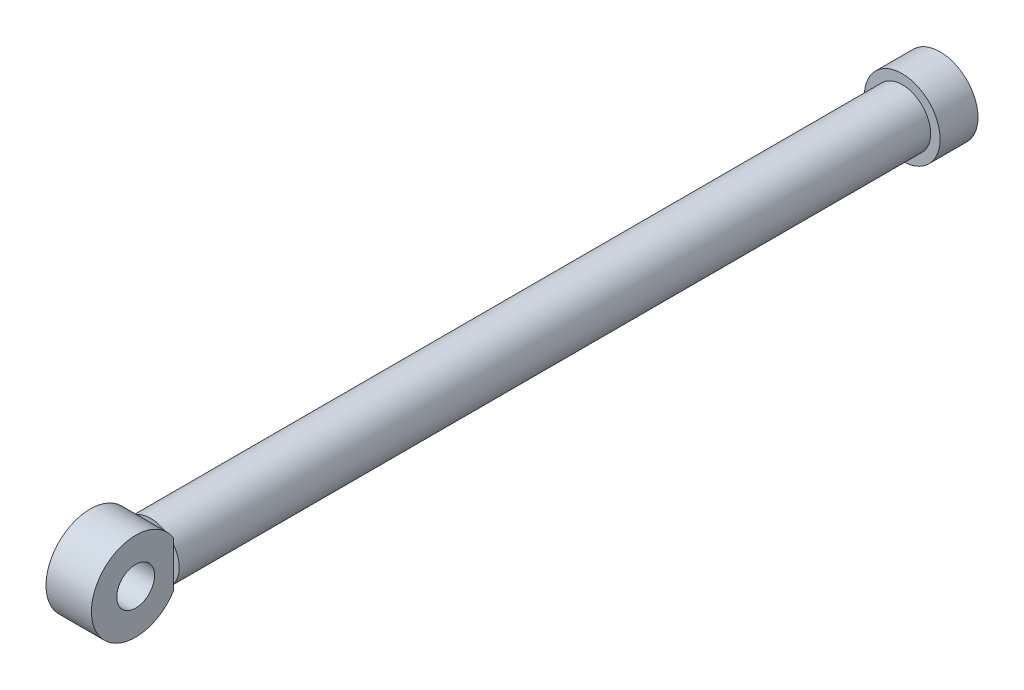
ISO-10303-21;
HEADER;
FILE_DESCRIPTION(('STEP AP214'),'2;1');
FILE_NAME('part.step','',(''),(''),'','','');
FILE_SCHEMA(('AUTOMOTIVE_DESIGN { 1 0 10303 214 1 1 1 1 }'));
ENDSEC;
DATA;
#1=APPLICATION_CONTEXT('core data for automotive mechanical design processes');
#2=APPLICATION_PROTOCOL_DEFINITION('international standard','automotive_design',2000,#1);
#3=PRODUCT_CONTEXT('',#1,'mechanical');
#4=PRODUCT('Part','Part','',(#3));
#5=PRODUCT_RELATED_PRODUCT_CATEGORY('part','',(#4));
#6=PRODUCT_DEFINITION_FORMATION('','',#4);
#7=PRODUCT_DEFINITION_CONTEXT('part definition',#1,'design');
#8=PRODUCT_DEFINITION('design','',#6,#7);
#9=PRODUCT_DEFINITION_SHAPE('','',#8);
#10=(LENGTH_UNIT() NAMED_UNIT(*) SI_UNIT(.MILLI.,.METRE.));
#11=(NAMED_UNIT(*) PLANE_ANGLE_UNIT() SI_UNIT($,.RADIAN.));
#12=(NAMED_UNIT(*) SI_UNIT($,.STERADIAN.) SOLID_ANGLE_UNIT());
#13=UNCERTAINTY_MEASURE_WITH_UNIT(LENGTH_MEASURE(1.E-05),#10,'distance_accuracy_value','');
#14=(GEOMETRIC_REPRESENTATION_CONTEXT(3) GLOBAL_UNCERTAINTY_ASSIGNED_CONTEXT((#13)) GLOBAL_UNIT_ASSIGNED_CONTEXT((#10,
#11,#12)) REPRESENTATION_CONTEXT('',''));
#15=CARTESIAN_POINT('',(0.,0.,0.));
#16=DIRECTION('',(0.,0.,1.));
#17=DIRECTION('',(1.,0.,0.));
#18=AXIS2_PLACEMENT_3D('',#15,#16,#17);
#19=CARTESIAN_POINT('',(0.,0.,625.));
#20=DIRECTION('',(0.,0.,1.));
#21=DIRECTION('',(1.,0.,0.));
#22=AXIS2_PLACEMENT_3D('',#19,#20,#21);
#23=PLANE('',#22);
#24=CARTESIAN_POINT('',(0.,0.,625.));
#25=DIRECTION('',(0.,0.,1.));
#26=DIRECTION('',(1.,0.,0.));
#27=AXIS2_PLACEMENT_3D('',#24,#25,#26);
#28=CIRCLE('',#27,22.5);
#29=CARTESIAN_POINT('',(-18.,13.5,625.));
#30=VERTEX_POINT('',#29);
#31=CARTESIAN_POINT('',(-18.,-13.5,625.));
#32=VERTEX_POINT('',#31);
#33=EDGE_CURVE('E148',#30,#32,#28,.T.);
#34=ORIENTED_EDGE('',*,*,#33,.T.);
#35=DIRECTION('',(0.,1.,0.));
#36=VECTOR('',#35,1.);
#37=CARTESIAN_POINT('',(-18.,0.,625.));
#38=LINE('',#37,#36);
#39=EDGE_CURVE('E47',#32,#30,#38,.T.);
#40=ORIENTED_EDGE('',*,*,#39,.T.);
#41=EDGE_LOOP('',(#34,#40));
#42=FACE_BOUND('',#41,.T.);
#43=ADVANCED_FACE('F39',(#42),#23,.T.);
#44=CARTESIAN_POINT('',(13.4629120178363,18.0277563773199,625.));
#45=VERTEX_POINT('',#44);
#46=CARTESIAN_POINT('',(-13.4629120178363,18.0277563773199,625.));
#47=VERTEX_POINT('',#46);
#48=EDGE_CURVE('E135',#45,#47,#28,.T.);
#49=ORIENTED_EDGE('',*,*,#48,.T.);
#50=DIRECTION('',(-1.,0.,0.));
#51=VECTOR('',#50,1.);
#52=CARTESIAN_POINT('',(18.,18.0277563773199,625.));
#53=LINE('',#52,#51);
#54=EDGE_CURVE('E143',#47,#45,#53,.F.);
#55=ORIENTED_EDGE('',*,*,#54,.T.);
#56=EDGE_LOOP('',(#49,#55));
#57=FACE_BOUND('',#56,.T.);
#58=ADVANCED_FACE('F173',(#57),#23,.T.);
#59=CARTESIAN_POINT('',(-13.4629120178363,-18.0277563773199,625.));
#60=VERTEX_POINT('',#59);
#61=CARTESIAN_POINT('',(13.4629120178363,-18.0277563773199,625.));
#62=VERTEX_POINT('',#61);
#63=EDGE_CURVE('E158',#60,#62,#28,.T.);
#64=ORIENTED_EDGE('',*,*,#63,.T.);
#65=DIRECTION('',(-1.,0.,0.));
#66=VECTOR('',#65,1.);
#67=CARTESIAN_POINT('',(18.,-18.0277563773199,625.));
#68=LINE('',#67,#66);
#69=EDGE_CURVE('E141',#62,#60,#68,.T.);
#70=ORIENTED_EDGE('',*,*,#69,.T.);
#71=EDGE_LOOP('',(#64,#70));
#72=FACE_BOUND('',#71,.T.);
#73=ADVANCED_FACE('F175',(#72),#23,.T.);
#74=CARTESIAN_POINT('',(0.,0.,30.));
#75=DIRECTION('',(0.,0.,1.));
#76=DIRECTION('',(1.,0.,0.));
#77=AXIS2_PLACEMENT_3D('',#74,#75,#76);
#78=PLANE('',#77);
#79=CARTESIAN_POINT('',(0.,0.,30.));
#80=DIRECTION('',(0.,0.,1.));
#81=DIRECTION('',(1.,0.,0.));
#82=AXIS2_PLACEMENT_3D('',#79,#80,#81);
#83=CIRCLE('',#82,30.);
#84=CARTESIAN_POINT('',(30.,0.,30.));
#85=VERTEX_POINT('',#84);
#86=EDGE_CURVE('E138',#85,#85,#83,.T.);
#87=ORIENTED_EDGE('',*,*,#86,.T.);
#88=EDGE_LOOP('',(#87));
#89=FACE_BOUND('',#88,.T.);
#90=CARTESIAN_POINT('',(0.,0.,30.));
#91=DIRECTION('',(0.,0.,1.));
#92=DIRECTION('',(1.,0.,0.));
#93=AXIS2_PLACEMENT_3D('',#90,#91,#92);
#94=CIRCLE('',#93,22.5);
#95=CARTESIAN_POINT('',(22.5,0.,30.));
#96=VERTEX_POINT('',#95);
#97=EDGE_CURVE('E128',#96,#96,#94,.T.);
#98=ORIENTED_EDGE('',*,*,#97,.F.);
#99=EDGE_LOOP('',(#98));
#100=FACE_BOUND('',#99,.T.);
#101=ADVANCED_FACE('F181',(#89,#100),#78,.T.);
#102=CARTESIAN_POINT('',(0.,0.,30.));
#103=DIRECTION('',(0.,0.,-1.));
#104=DIRECTION('',(-1.,0.,0.));
#105=AXIS2_PLACEMENT_3D('',#102,#103,#104);
#106=CYLINDRICAL_SURFACE('',#105,30.);
#107=ORIENTED_EDGE('',*,*,#86,.F.);
#108=EDGE_LOOP('',(#107));
#109=FACE_BOUND('',#108,.T.);
#110=CARTESIAN_POINT('',(0.,0.,0.));
#111=DIRECTION('',(0.,0.,1.));
#112=DIRECTION('',(1.,0.,0.));
#113=AXIS2_PLACEMENT_3D('',#110,#111,#112);
#114=CIRCLE('',#113,30.);
#115=CARTESIAN_POINT('',(30.,0.,0.));
#116=VERTEX_POINT('',#115);
#117=EDGE_CURVE('E134',#116,#116,#114,.T.);
#118=ORIENTED_EDGE('',*,*,#117,.T.);
#119=EDGE_LOOP('',(#118));
#120=FACE_BOUND('',#119,.T.);
#121=ADVANCED_FACE('F41',(#109,#120),#106,.T.);
#122=CARTESIAN_POINT('',(0.,0.,0.));
#123=DIRECTION('',(0.,0.,1.));
#124=DIRECTION('',(1.,0.,0.));
#125=AXIS2_PLACEMENT_3D('',#122,#123,#124);
#126=PLANE('',#125);
#127=ORIENTED_EDGE('',*,*,#117,.F.);
#128=EDGE_LOOP('',(#127));
#129=FACE_BOUND('',#128,.T.);
#130=ADVANCED_FACE('F188',(#129),#126,.F.);
#131=CARTESIAN_POINT('',(0.,0.,625.));
#132=DIRECTION('',(0.,0.,-1.));
#133=DIRECTION('',(-1.,0.,0.));
#134=AXIS2_PLACEMENT_3D('',#131,#132,#133);
#135=CYLINDRICAL_SURFACE('',#134,22.5);
#136=CARTESIAN_POINT('',(18.,13.5,625.));
#137=VERTEX_POINT('',#136);
#138=EDGE_CURVE('E132',#137,#45,#28,.T.);
#139=ORIENTED_EDGE('',*,*,#138,.F.);
#140=CARTESIAN_POINT('',(18.,-13.5,625.));
#141=VERTEX_POINT('',#140);
#142=EDGE_CURVE('E131',#141,#137,#28,.T.);
#143=ORIENTED_EDGE('',*,*,#142,.F.);
#144=EDGE_CURVE('E160',#62,#141,#28,.T.);
#145=ORIENTED_EDGE('',*,*,#144,.F.);
#146=ORIENTED_EDGE('',*,*,#63,.F.);
#147=EDGE_CURVE('E94',#32,#60,#28,.T.);
#148=ORIENTED_EDGE('',*,*,#147,.F.);
#149=ORIENTED_EDGE('',*,*,#33,.F.);
#150=EDGE_CURVE('E155',#47,#30,#28,.T.);
#151=ORIENTED_EDGE('',*,*,#150,.F.);
#152=ORIENTED_EDGE('',*,*,#48,.F.);
#153=EDGE_LOOP('',(#139,#143,#145,#146,#148,#149,#151,#152));
#154=FACE_BOUND('',#153,.T.);
#155=ORIENTED_EDGE('',*,*,#97,.T.);
#156=EDGE_LOOP('',(#155));
#157=FACE_BOUND('',#156,.T.);
#158=ADVANCED_FACE('F152',(#154,#157),#135,.T.);
#159=DIRECTION('',(0.,1.,0.));
#160=VECTOR('',#159,1.);
#161=CARTESIAN_POINT('',(18.,0.,625.));
#162=LINE('',#161,#160);
#163=EDGE_CURVE('E11',#141,#137,#162,.T.);
#164=ORIENTED_EDGE('',*,*,#163,.F.);
#165=ORIENTED_EDGE('',*,*,#142,.T.);
#166=EDGE_LOOP('',(#164,#165));
#167=FACE_BOUND('',#166,.T.);
#168=ADVANCED_FACE('F168',(#167),#23,.T.);
#169=CARTESIAN_POINT('',(18.,18.0277563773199,625.));
#170=DIRECTION('',(0.,0.,1.));
#171=DIRECTION('',(1.,0.,0.));
#172=AXIS2_PLACEMENT_3D('',#169,#170,#171);
#173=PLANE('',#172);
#174=DIRECTION('',(0.,1.,0.));
#175=VECTOR('',#174,1.);
#176=CARTESIAN_POINT('',(18.,18.0277563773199,625.));
#177=LINE('',#176,#175);
#178=CARTESIAN_POINT('',(18.,18.0277563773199,625.));
#179=VERTEX_POINT('',#178);
#180=EDGE_CURVE('E62',#137,#179,#177,.T.);
#181=ORIENTED_EDGE('',*,*,#180,.F.);
#182=ORIENTED_EDGE('',*,*,#138,.T.);
#183=DIRECTION('',(-1.,0.,0.));
#184=VECTOR('',#183,1.);
#185=CARTESIAN_POINT('',(18.,18.0277563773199,625.));
#186=LINE('',#185,#184);
#187=EDGE_CURVE('E97',#179,#45,#186,.T.);
#188=ORIENTED_EDGE('',*,*,#187,.F.);
#189=EDGE_LOOP('',(#181,#182,#188));
#190=FACE_BOUND('',#189,.T.);
#191=ADVANCED_FACE('F169',(#190),#173,.F.);
#192=CARTESIAN_POINT('',(-18.,18.0277563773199,625.));
#193=VERTEX_POINT('',#192);
#194=EDGE_CURVE('E112',#47,#193,#186,.T.);
#195=ORIENTED_EDGE('',*,*,#194,.F.);
#196=ORIENTED_EDGE('',*,*,#150,.T.);
#197=DIRECTION('',(0.,1.,0.));
#198=VECTOR('',#197,1.);
#199=CARTESIAN_POINT('',(-18.,18.0277563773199,625.));
#200=LINE('',#199,#198);
#201=EDGE_CURVE('E107',#30,#193,#200,.T.);
#202=ORIENTED_EDGE('',*,*,#201,.T.);
#203=EDGE_LOOP('',(#195,#196,#202));
#204=FACE_BOUND('',#203,.T.);
#205=ADVANCED_FACE('F235',(#204),#173,.F.);
#206=CARTESIAN_POINT('',(-18.,-18.0277563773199,625.));
#207=VERTEX_POINT('',#206);
#208=EDGE_CURVE('E92',#207,#32,#200,.T.);
#209=ORIENTED_EDGE('',*,*,#208,.T.);
#210=ORIENTED_EDGE('',*,*,#147,.T.);
#211=DIRECTION('',(-1.,0.,0.));
#212=VECTOR('',#211,1.);
#213=CARTESIAN_POINT('',(18.,-18.0277563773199,625.));
#214=LINE('',#213,#212);
#215=EDGE_CURVE('E54',#60,#207,#214,.T.);
#216=ORIENTED_EDGE('',*,*,#215,.T.);
#217=EDGE_LOOP('',(#209,#210,#216));
#218=FACE_BOUND('',#217,.T.);
#219=ADVANCED_FACE('F91',(#218),#173,.F.);
#220=CARTESIAN_POINT('',(18.,-18.0277563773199,625.));
#221=VERTEX_POINT('',#220);
#222=EDGE_CURVE('E96',#221,#62,#214,.T.);
#223=ORIENTED_EDGE('',*,*,#222,.T.);
#224=ORIENTED_EDGE('',*,*,#144,.T.);
#225=EDGE_CURVE('E122',#221,#141,#177,.T.);
#226=ORIENTED_EDGE('',*,*,#225,.F.);
#227=EDGE_LOOP('',(#223,#224,#226));
#228=FACE_BOUND('',#227,.T.);
#229=ADVANCED_FACE('F236',(#228),#173,.F.);
#230=CARTESIAN_POINT('',(18.,0.,655.));
#231=DIRECTION('',(1.,0.,0.));
#232=DIRECTION('',(0.,0.,-1.));
#233=AXIS2_PLACEMENT_3D('',#230,#231,#232);
#234=PLANE('',#233);
#235=CARTESIAN_POINT('',(18.,0.,655.));
#236=DIRECTION('',(1.,0.,0.));
#237=DIRECTION('',(0.,0.,-1.));
#238=AXIS2_PLACEMENT_3D('',#235,#236,#237);
#239=CIRCLE('',#238,35.);
#240=EDGE_CURVE('E106',#179,#221,#239,.T.);
#241=ORIENTED_EDGE('',*,*,#240,.T.);
#242=ORIENTED_EDGE('',*,*,#225,.T.);
#243=ORIENTED_EDGE('',*,*,#163,.T.);
#244=ORIENTED_EDGE('',*,*,#180,.T.);
#245=EDGE_LOOP('',(#241,#242,#243,#244));
#246=FACE_BOUND('',#245,.T.);
#247=CARTESIAN_POINT('',(18.,0.,655.));
#248=DIRECTION('',(1.,0.,0.));
#249=DIRECTION('',(0.,0.,-1.));
#250=AXIS2_PLACEMENT_3D('',#247,#248,#249);
#251=CIRCLE('',#250,15.);
#252=CARTESIAN_POINT('',(18.,0.,640.));
#253=VERTEX_POINT('',#252);
#254=EDGE_CURVE('E113',#253,#253,#251,.T.);
#255=ORIENTED_EDGE('',*,*,#254,.F.);
#256=EDGE_LOOP('',(#255));
#257=FACE_BOUND('',#256,.T.);
#258=ADVANCED_FACE('F253',(#246,#257),#234,.T.);
#259=CARTESIAN_POINT('',(-18.,0.,655.));
#260=DIRECTION('',(1.,0.,0.));
#261=DIRECTION('',(0.,0.,-1.));
#262=AXIS2_PLACEMENT_3D('',#259,#260,#261);
#263=PLANE('',#262);
#264=CARTESIAN_POINT('',(-18.,0.,655.));
#265=DIRECTION('',(1.,0.,0.));
#266=DIRECTION('',(0.,0.,-1.));
#267=AXIS2_PLACEMENT_3D('',#264,#265,#266);
#268=CIRCLE('',#267,35.);
#269=EDGE_CURVE('E104',#193,#207,#268,.T.);
#270=ORIENTED_EDGE('',*,*,#269,.F.);
#271=ORIENTED_EDGE('',*,*,#201,.F.);
#272=ORIENTED_EDGE('',*,*,#39,.F.);
#273=ORIENTED_EDGE('',*,*,#208,.F.);
#274=EDGE_LOOP('',(#270,#271,#272,#273));
#275=FACE_BOUND('',#274,.T.);
#276=CARTESIAN_POINT('',(-18.,0.,655.));
#277=DIRECTION('',(1.,0.,0.));
#278=DIRECTION('',(0.,0.,-1.));
#279=AXIS2_PLACEMENT_3D('',#276,#277,#278);
#280=CIRCLE('',#279,15.);
#281=CARTESIAN_POINT('',(-18.,0.,640.));
#282=VERTEX_POINT('',#281);
#283=EDGE_CURVE('E116',#282,#282,#280,.T.);
#284=ORIENTED_EDGE('',*,*,#283,.T.);
#285=EDGE_LOOP('',(#284));
#286=FACE_BOUND('',#285,.T.);
#287=ADVANCED_FACE('F101',(#275,#286),#263,.F.);
#288=CARTESIAN_POINT('',(18.,0.,655.));
#289=DIRECTION('',(-1.,0.,0.));
#290=DIRECTION('',(0.,0.,1.));
#291=AXIS2_PLACEMENT_3D('',#288,#289,#290);
#292=CYLINDRICAL_SURFACE('',#291,35.);
#293=ORIENTED_EDGE('',*,*,#269,.T.);
#294=ORIENTED_EDGE('',*,*,#215,.F.);
#295=ORIENTED_EDGE('',*,*,#69,.F.);
#296=ORIENTED_EDGE('',*,*,#222,.F.);
#297=ORIENTED_EDGE('',*,*,#240,.F.);
#298=ORIENTED_EDGE('',*,*,#187,.T.);
#299=ORIENTED_EDGE('',*,*,#54,.F.);
#300=ORIENTED_EDGE('',*,*,#194,.T.);
#301=EDGE_LOOP('',(#293,#294,#295,#296,#297,#298,#299,#300));
#302=FACE_BOUND('',#301,.T.);
#303=ADVANCED_FACE('F110',(#302),#292,.T.);
#304=CARTESIAN_POINT('',(18.,0.,655.));
#305=DIRECTION('',(-1.,0.,0.));
#306=DIRECTION('',(0.,0.,1.));
#307=AXIS2_PLACEMENT_3D('',#304,#305,#306);
#308=CYLINDRICAL_SURFACE('',#307,15.);
#309=ORIENTED_EDGE('',*,*,#254,.T.);
#310=EDGE_LOOP('',(#309));
#311=FACE_BOUND('',#310,.T.);
#312=ORIENTED_EDGE('',*,*,#283,.F.);
#313=EDGE_LOOP('',(#312));
#314=FACE_BOUND('',#313,.T.);
#315=ADVANCED_FACE('F272',(#311,#314),#308,.F.);
#316=CLOSED_SHELL('',(#43,#58,#73,#101,#121,#130,#158,#168,#191,#205,#219,#229,#258,#287,#303,#315));
#317=MANIFOLD_SOLID_BREP('B2',#316);
#318=ADVANCED_BREP_SHAPE_REPRESENTATION('',(#18,#317),#14);
#319=SHAPE_DEFINITION_REPRESENTATION(#9,#318);
ENDSEC;
END-ISO-10303-21;
